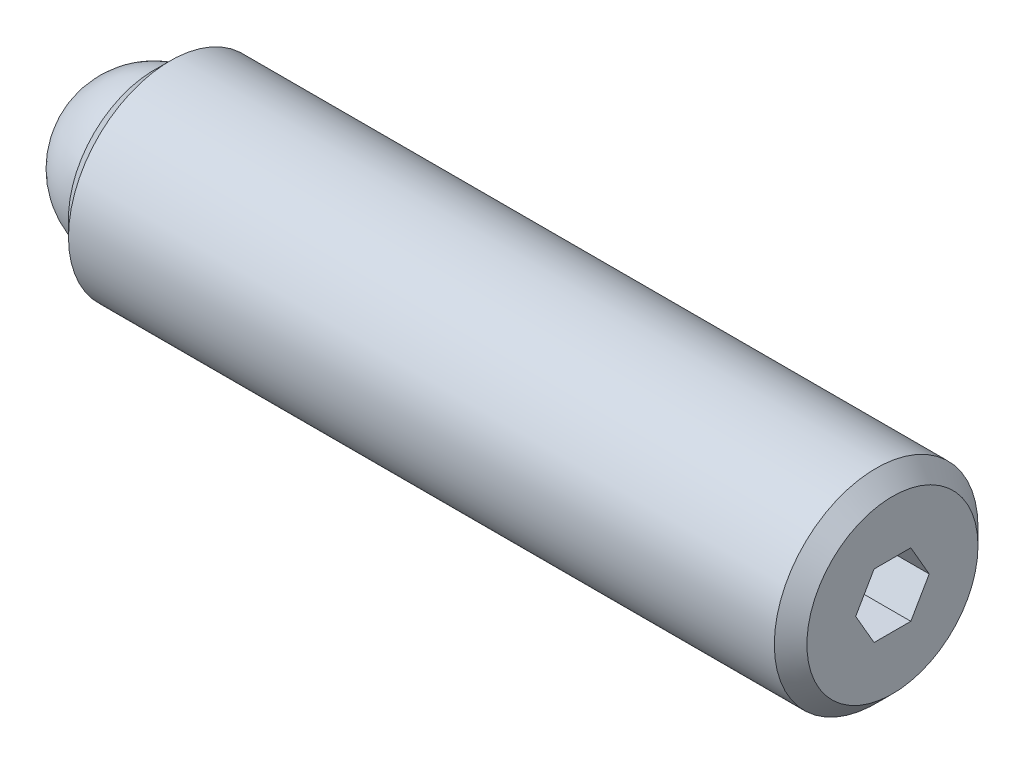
from build123d import *

# Parameters (mm, degrees)
SKETCH2_R           = 3.175
BOSS_EXTRUDE1_DEPTH = 23.01875
CHAMFER1_SIZE       = 0.508
CHAMFER2_SIZE       = 0.508
CUT_EXTRUDE2_DEPTH  = 2.286
SKETCH3_R           = 2.38125
CUT_EXTRUDE3_DEPTH  = 1.984375


with BuildPart() as part:
    # Sketch2 → Boss-Extrude1 (new body)
    with BuildSketch(Plane(origin=(0, 0, 0), x_dir=(0, 0, -1), z_dir=(1, 0, 0))):
        Circle(SKETCH2_R)
    extrude(amount=BOSS_EXTRUDE1_DEPTH)

    # Chamfer1
    chamfer1_edges = [part.edges().sort_by_distance(p)[0] for p in [
        (0, 0, 3.175),
    ]]
    chamfer(chamfer1_edges, length=CHAMFER1_SIZE)

    # Chamfer2
    chamfer2_edges = [part.edges().sort_by_distance(p)[0] for p in [
        (23.01875, 0, 3.175),
    ]]
    chamfer(chamfer2_edges, length=CHAMFER2_SIZE)

    # Sketch4 → Cut-Extrude2 (cut)
    with BuildSketch(Plane(origin=(23.01875, 0, 0), x_dir=(0, 0, -1), z_dir=(1, 0, 0))):
        Polygon((1.14567944, 0), (0.57283972, 0.9921875), (-0.57283972, 0.9921875), (-1.14567944, 0), (-0.57283972, -0.9921875), (0.57283972, -0.9921875), align=None)
    extrude(amount=-CUT_EXTRUDE2_DEPTH, mode=Mode.SUBTRACT)

    # Sketch3 → Cut-Extrude3 (cut)
    with BuildSketch(Plane.ZY):
        Circle(SKETCH3_R)
    extrude(amount=-CUT_EXTRUDE3_DEPTH, mode=Mode.SUBTRACT)


with BuildPart() as body_2:
    # Sketch5 → Revolve1 (revolve)
    with BuildSketch(Plane.ZY):
        with BuildLine():
            Line((0, 0), (0, -2.38125))
            ThreePointArc((0, -2.38125), (-2.38125, 0), (0, 2.38125))
            Line((0, 2.38125), (0, 0))
        make_face()
    revolve(axis=Axis((0, 0, 0), (0, 1, 0)))


solid = Compound([part.part, body_2.part])
